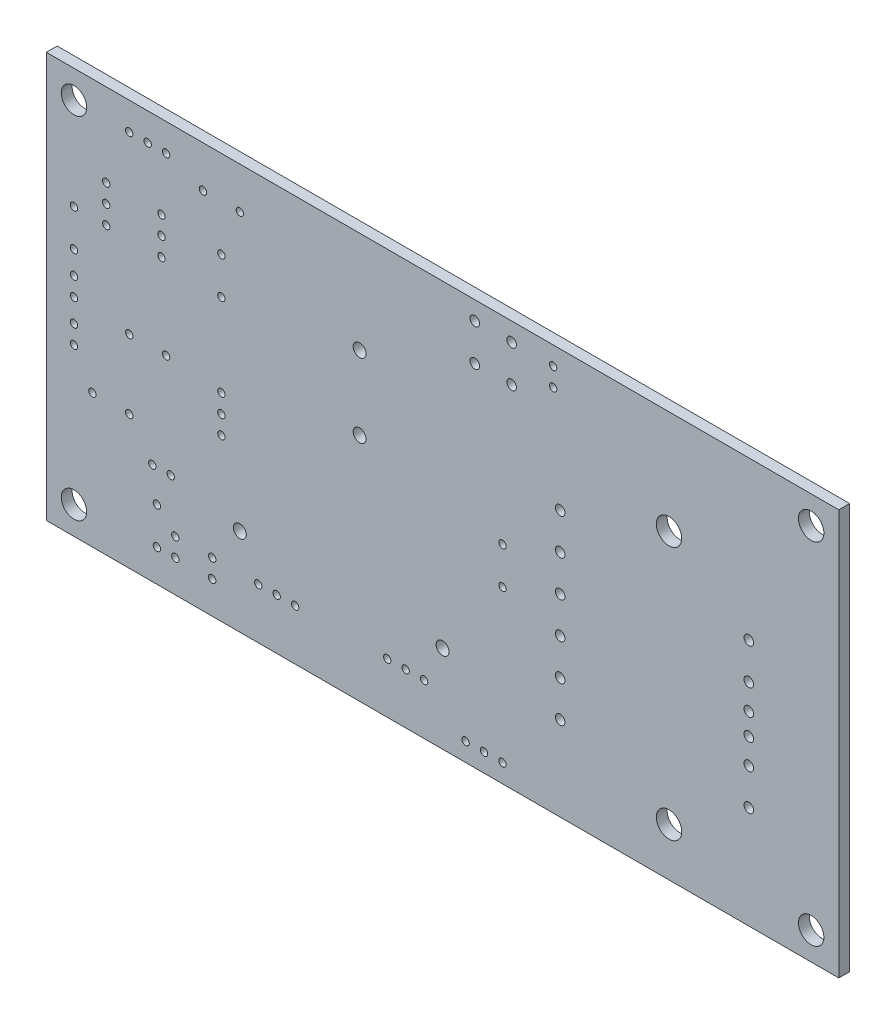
from build123d import *

# Parameters (mm, degrees)
SKETCH_1_W          = 109.22
SKETCH_1_H          = 55.88
EXTRUDE_1_DEPTH     = 1.4986
SKETCH_2_R          = 1.7526
SKETCH_2_R_2        = 0.508
SKETCH_2_R_3        = 0.889
SKETCH_2_R_4        = 0.6604
CUT_EXTRUDE_1_DEPTH = 1.4986


with BuildPart() as part:
    # Sketch 1 → Extrude 1 (new body)
    with BuildSketch(Plane.XY):
        with Locations((54.61, -27.94)):
            Rectangle(SKETCH_1_W, SKETCH_1_H)
    extrude(amount=EXTRUDE_1_DEPTH)

    # Sketch 2 → Cut-Extrude 1 (cut)
    with BuildSketch(Plane.XY.offset(1.4986)):
        with Locations((3.81, -3.81)):
            Circle(SKETCH_2_R)
        with Locations((3.81, -52.07)):
            Circle(SKETCH_2_R)
        with Locations((105.41, -3.81)):
            Circle(SKETCH_2_R)
        with Locations((105.41, -52.07)):
            Circle(SKETCH_2_R)
        with Locations((11.43, -3.81)):
            Circle(SKETCH_2_R_2)
        with Locations((13.97, -3.81)):
            Circle(SKETCH_2_R_2)
        with Locations((16.51, -3.81)):
            Circle(SKETCH_2_R_2)
        with Locations((21.59, -5.715)):
            Circle(SKETCH_2_R_2)
        with Locations((26.67, -5.715)):
            Circle(SKETCH_2_R_2)
        with Locations((8.255, -11.43)):
            Circle(SKETCH_2_R_2)
        with Locations((8.255, -13.97)):
            Circle(SKETCH_2_R_2)
        with Locations((8.255, -16.51)):
            Circle(SKETCH_2_R_2)
        with Locations((15.875, -11.43)):
            Circle(SKETCH_2_R_2)
        with Locations((15.875, -13.97)):
            Circle(SKETCH_2_R_2)
        with Locations((15.875, -16.51)):
            Circle(SKETCH_2_R_2)
        with Locations((24.13, -12.065)):
            Circle(SKETCH_2_R_2)
        with Locations((24.13, -17.145)):
            Circle(SKETCH_2_R_2)
        with Locations((3.81, -16.51)):
            Circle(SKETCH_2_R_2)
        with Locations((3.81, -21.59)):
            Circle(SKETCH_2_R_2)
        with Locations((3.81, -24.765)):
            Circle(SKETCH_2_R_2)
        with Locations((3.81, -27.305)):
            Circle(SKETCH_2_R_2)
        with Locations((3.81, -30.48)):
            Circle(SKETCH_2_R_2)
        with Locations((3.81, -33.02)):
            Circle(SKETCH_2_R_2)
        with Locations((11.43, -27.94)):
            Circle(SKETCH_2_R_2)
        with Locations((16.51, -27.94)):
            Circle(SKETCH_2_R_2)
        with Locations((24.13, -28.575)):
            Circle(SKETCH_2_R_2)
        with Locations((24.13, -31.115)):
            Circle(SKETCH_2_R_2)
        with Locations((24.13, -33.655)):
            Circle(SKETCH_2_R_2)
        with Locations((6.35, -37.465)):
            Circle(SKETCH_2_R_2)
        with Locations((11.43, -37.465)):
            Circle(SKETCH_2_R_2)
        with Locations((14.605, -41.91)):
            Circle(SKETCH_2_R_2)
        with Locations((17.145, -41.91)):
            Circle(SKETCH_2_R_2)
        with Locations((15.24, -46.355)):
            Circle(SKETCH_2_R_2)
        with Locations((15.24, -51.435)):
            Circle(SKETCH_2_R_2)
        with Locations((17.78, -48.895)):
            Circle(SKETCH_2_R_2)
        with Locations((22.86, -48.895)):
            Circle(SKETCH_2_R_2)
        with Locations((17.78, -51.435)):
            Circle(SKETCH_2_R_2)
        with Locations((22.86, -51.435)):
            Circle(SKETCH_2_R_2)
        with Locations((26.67, -43.815)):
            Circle(SKETCH_2_R_3)
        with Locations((54.61, -43.815)):
            Circle(SKETCH_2_R_3)
        with Locations((29.21, -48.895)):
            Circle(SKETCH_2_R_2)
        with Locations((31.75, -48.895)):
            Circle(SKETCH_2_R_2)
        with Locations((34.29, -48.895)):
            Circle(SKETCH_2_R_2)
        with Locations((46.99, -48.895)):
            Circle(SKETCH_2_R_2)
        with Locations((49.53, -48.895)):
            Circle(SKETCH_2_R_2)
        with Locations((52.07, -48.895)):
            Circle(SKETCH_2_R_2)
        with Locations((57.785, -53.34)):
            Circle(SKETCH_2_R_2)
        with Locations((60.325, -53.34)):
            Circle(SKETCH_2_R_2)
        with Locations((62.865, -53.34)):
            Circle(SKETCH_2_R_2)
        with Locations((62.865, -32.385)):
            Circle(SKETCH_2_R_2)
        with Locations((62.865, -27.305)):
            Circle(SKETCH_2_R_2)
        with Locations((43.18, -24.13)):
            Circle(SKETCH_2_R_3)
        with Locations((43.18, -13.97)):
            Circle(SKETCH_2_R_3)
        with Locations((59.055, -2.54)):
            Circle(SKETCH_2_R_4)
        with Locations((64.135, -2.54)):
            Circle(SKETCH_2_R_4)
        with Locations((59.055, -7.62)):
            Circle(SKETCH_2_R_4)
        with Locations((64.135, -7.62)):
            Circle(SKETCH_2_R_4)
        with Locations((69.85, -2.54)):
            Circle(SKETCH_2_R_2)
        with Locations((69.85, -5.08)):
            Circle(SKETCH_2_R_2)
        with Locations((70.82028, -19.25066)):
            Circle(SKETCH_2_R_4)
        with Locations((70.82028, -24.24938)):
            Circle(SKETCH_2_R_4)
        with Locations((70.82028, -29.25064)):
            Circle(SKETCH_2_R_4)
        with Locations((70.82028, -34.24936)):
            Circle(SKETCH_2_R_4)
        with Locations((70.82028, -39.25062)):
            Circle(SKETCH_2_R_4)
        with Locations((70.82028, -44.24934)):
            Circle(SKETCH_2_R_4)
        with Locations((96.81972, -21.75002)):
            Circle(SKETCH_2_R_4)
        with Locations((96.81972, -26.74874)):
            Circle(SKETCH_2_R_4)
        with Locations((96.81972, -30.24886)):
            Circle(SKETCH_2_R_4)
        with Locations((96.81972, -33.25114)):
            Circle(SKETCH_2_R_4)
        with Locations((96.81972, -36.75126)):
            Circle(SKETCH_2_R_4)
        with Locations((85.81898, -14.2494)):
            Circle(SKETCH_2_R)
        with Locations((85.81898, -49.2506)):
            Circle(SKETCH_2_R)
        with Locations((96.81972, -41.74998)):
            Circle(SKETCH_2_R_4)
    extrude(amount=-CUT_EXTRUDE_1_DEPTH, mode=Mode.SUBTRACT)


solid = part.part
